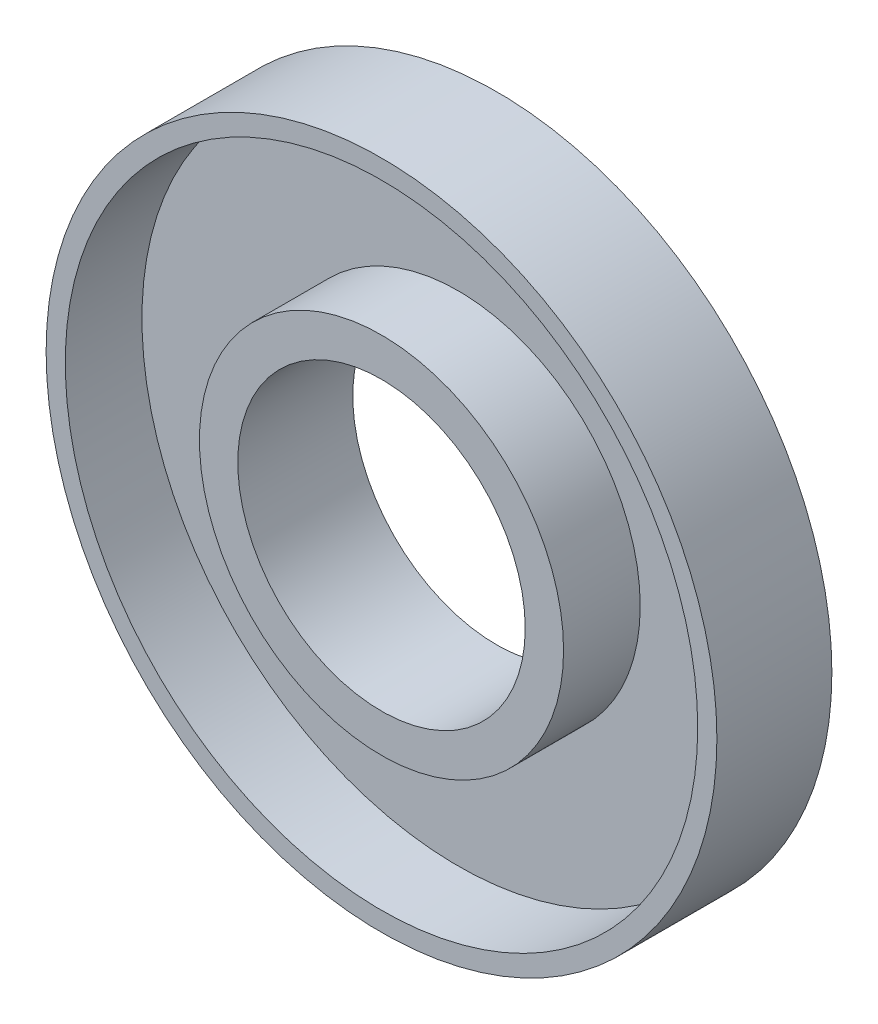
from build123d import *

# Parameters (mm, degrees)
ESQUISSE1_R        = 17.5
ESQUISSE1_R_2      = 7.5
BOSS_EXTRU_1_DEPTH = 2
ESQUISSE2_R        = 17.5
ESQUISSE2_R_2      = 16.5
BOSS_EXTRU_2_DEPTH = 4
ESQUISSE3_R        = 9.5
ESQUISSE3_R_2      = 7.5
BOSS_EXTRU_3_DEPTH = 4


with BuildPart() as part:
    # Esquisse1 → Boss.-Extru.1 (new body)
    with BuildSketch(Plane.XY):
        Circle(ESQUISSE1_R)
        Circle(ESQUISSE1_R_2, mode=Mode.SUBTRACT)
    extrude(amount=BOSS_EXTRU_1_DEPTH)

    # Esquisse2 → Boss.-Extru.2 (add)
    with BuildSketch(Plane.XY.offset(2)):
        Circle(ESQUISSE2_R)
        Circle(ESQUISSE2_R_2, mode=Mode.SUBTRACT)
    extrude(amount=BOSS_EXTRU_2_DEPTH)

    # Esquisse3 → Boss.-Extru.3 (add)
    with BuildSketch(Plane.XY.offset(2)):
        Circle(ESQUISSE3_R)
        Circle(ESQUISSE3_R_2, mode=Mode.SUBTRACT)
    extrude(amount=BOSS_EXTRU_3_DEPTH)


solid = part.part
